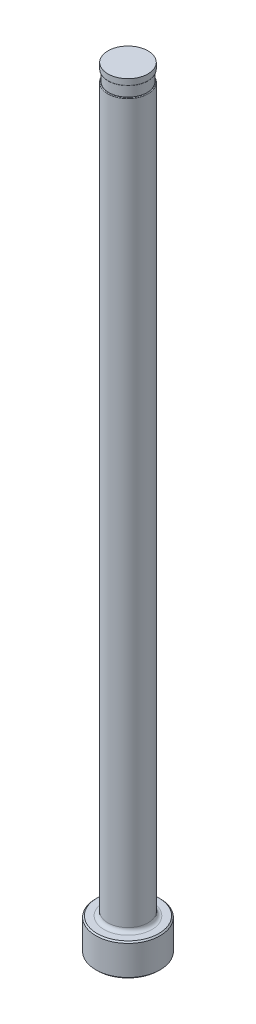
ISO-10303-21;
HEADER;
FILE_DESCRIPTION(('STEP AP214'),'2;1');
FILE_NAME('part.step','',(''),(''),'','','');
FILE_SCHEMA(('AUTOMOTIVE_DESIGN { 1 0 10303 214 1 1 1 1 }'));
ENDSEC;
DATA;
#1=APPLICATION_CONTEXT('core data for automotive mechanical design processes');
#2=APPLICATION_PROTOCOL_DEFINITION('international standard','automotive_design',2000,#1);
#3=PRODUCT_CONTEXT('',#1,'mechanical');
#4=PRODUCT('Part','Part','',(#3));
#5=PRODUCT_RELATED_PRODUCT_CATEGORY('part','',(#4));
#6=PRODUCT_DEFINITION_FORMATION('','',#4);
#7=PRODUCT_DEFINITION_CONTEXT('part definition',#1,'design');
#8=PRODUCT_DEFINITION('design','',#6,#7);
#9=PRODUCT_DEFINITION_SHAPE('','',#8);
#10=(LENGTH_UNIT() NAMED_UNIT(*) SI_UNIT(.MILLI.,.METRE.));
#11=(NAMED_UNIT(*) PLANE_ANGLE_UNIT() SI_UNIT($,.RADIAN.));
#12=(NAMED_UNIT(*) SI_UNIT($,.STERADIAN.) SOLID_ANGLE_UNIT());
#13=UNCERTAINTY_MEASURE_WITH_UNIT(LENGTH_MEASURE(1.E-05),#10,'distance_accuracy_value','');
#14=(GEOMETRIC_REPRESENTATION_CONTEXT(3) GLOBAL_UNCERTAINTY_ASSIGNED_CONTEXT((#13)) GLOBAL_UNIT_ASSIGNED_CONTEXT((#10,
#11,#12)) REPRESENTATION_CONTEXT('',''));
#15=CARTESIAN_POINT('',(0.,0.,0.));
#16=DIRECTION('',(0.,0.,1.));
#17=DIRECTION('',(1.,0.,0.));
#18=AXIS2_PLACEMENT_3D('',#15,#16,#17);
#19=CARTESIAN_POINT('',(-3.96874999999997,151.13,0.));
#20=DIRECTION('',(0.,1.,0.));
#21=DIRECTION('',(0.,0.,1.));
#22=AXIS2_PLACEMENT_3D('',#19,#20,#21);
#23=PLANE('',#22);
#24=CARTESIAN_POINT('',(0.,151.13,0.));
#25=DIRECTION('',(0.,1.,0.));
#26=DIRECTION('',(0.,0.,1.));
#27=AXIS2_PLACEMENT_3D('',#24,#25,#26);
#28=CIRCLE('',#27,3.82904999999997);
#29=CARTESIAN_POINT('',(0.,151.13,3.82904999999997));
#30=VERTEX_POINT('',#29);
#31=EDGE_CURVE('E11',#30,#30,#28,.F.);
#32=ORIENTED_EDGE('',*,*,#31,.T.);
#33=EDGE_LOOP('',(#32));
#34=FACE_BOUND('',#33,.T.);
#35=CARTESIAN_POINT('',(0.,151.13,0.));
#36=DIRECTION('',(0.,1.,0.));
#37=DIRECTION('',(0.,0.,1.));
#38=AXIS2_PLACEMENT_3D('',#35,#36,#37);
#39=CIRCLE('',#38,3.76554999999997);
#40=CARTESIAN_POINT('',(0.,151.13,3.76554999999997));
#41=VERTEX_POINT('',#40);
#42=EDGE_CURVE('E78',#41,#41,#39,.T.);
#43=ORIENTED_EDGE('',*,*,#42,.T.);
#44=EDGE_LOOP('',(#43));
#45=FACE_BOUND('',#44,.T.);
#46=ADVANCED_FACE('F36',(#34,#45),#23,.F.);
#47=CARTESIAN_POINT('',(0.,259.958771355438,0.));
#48=DIRECTION('',(0.,1.,0.));
#49=DIRECTION('',(0.,0.,1.));
#50=AXIS2_PLACEMENT_3D('',#47,#48,#49);
#51=CYLINDRICAL_SURFACE('',#50,3.96874999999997);
#52=DIRECTION('',(0.,1.,0.));
#53=VECTOR('',#52,1.);
#54=CARTESIAN_POINT('',(-3.76554999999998,259.958771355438,-1.25363860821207));
#55=LINE('',#54,#53);
#56=CARTESIAN_POINT('',(-3.76554999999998,148.971,-1.25363860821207));
#57=VERTEX_POINT('',#56);
#58=CARTESIAN_POINT('',(-3.76554999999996,86.614,-1.25363860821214));
#59=VERTEX_POINT('',#58);
#60=EDGE_CURVE('E73',#57,#59,#55,.F.);
#61=ORIENTED_EDGE('',*,*,#60,.F.);
#62=CARTESIAN_POINT('',(0.,148.971,0.));
#63=DIRECTION('',(0.,-1.,0.));
#64=DIRECTION('',(0.,0.,-1.));
#65=AXIS2_PLACEMENT_3D('',#62,#63,#64);
#66=CIRCLE('',#65,3.96874999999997);
#67=CARTESIAN_POINT('',(-3.76554999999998,148.971,1.25363860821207));
#68=VERTEX_POINT('',#67);
#69=EDGE_CURVE('E51',#57,#68,#66,.T.);
#70=ORIENTED_EDGE('',*,*,#69,.T.);
#71=DIRECTION('',(0.,1.,0.));
#72=VECTOR('',#71,1.);
#73=CARTESIAN_POINT('',(-3.76554999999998,259.958771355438,1.25363860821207));
#74=LINE('',#73,#72);
#75=CARTESIAN_POINT('',(-3.76554999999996,86.614,1.25363860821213));
#76=VERTEX_POINT('',#75);
#77=EDGE_CURVE('E84',#76,#68,#74,.T.);
#78=ORIENTED_EDGE('',*,*,#77,.F.);
#79=CARTESIAN_POINT('',(-3.76554999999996,86.614,-1.25363860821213));
#80=CARTESIAN_POINT('',(-3.76554761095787,86.5842664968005,-1.25363893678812));
#81=CARTESIAN_POINT('',(-3.76596820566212,86.5545487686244,-1.25238314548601));
#82=CARTESIAN_POINT('',(-3.76762981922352,86.4953538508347,-1.24737825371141));
#83=CARTESIAN_POINT('',(-3.76887065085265,86.4658766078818,-1.24362972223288));
#84=CARTESIAN_POINT('',(-3.77377172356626,86.3783445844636,-1.22871446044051));
#85=CARTESIAN_POINT('',(-3.7786109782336,86.3209361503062,-1.21387766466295));
#86=CARTESIAN_POINT('',(-3.79089599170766,86.2097164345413,-1.17494432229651));
#87=CARTESIAN_POINT('',(-3.79834108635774,86.1559042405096,-1.15085013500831));
#88=CARTESIAN_POINT('',(-3.81503450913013,86.0532087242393,-1.09423745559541));
#89=CARTESIAN_POINT('',(-3.82428345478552,86.0043270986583,-1.06171607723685));
#90=CARTESIAN_POINT('',(-3.84371902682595,85.912215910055,-0.989050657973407));
#91=CARTESIAN_POINT('',(-3.85391232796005,85.8690327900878,-0.94884982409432));
#92=CARTESIAN_POINT('',(-3.87421414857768,85.789439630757,-0.862218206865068));
#93=CARTESIAN_POINT('',(-3.88432263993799,85.7530317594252,-0.815785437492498));
#94=CARTESIAN_POINT('',(-3.90447970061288,85.6843203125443,-0.713424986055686));
#95=CARTESIAN_POINT('',(-3.91443636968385,85.6527071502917,-0.657016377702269));
#96=CARTESIAN_POINT('',(-3.93230837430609,85.5981594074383,-0.539855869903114));
#97=CARTESIAN_POINT('',(-3.94022284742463,85.5752284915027,-0.479102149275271));
#98=CARTESIAN_POINT('',(-3.95405226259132,85.5360681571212,-0.348163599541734));
#99=CARTESIAN_POINT('',(-3.95966879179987,85.520798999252,-0.277659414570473));
#100=CARTESIAN_POINT('',(-3.96709876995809,85.5007501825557,-0.134969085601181));
#101=CARTESIAN_POINT('',(-3.96891039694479,85.4959755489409,-0.0627821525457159));
#102=CARTESIAN_POINT('',(-3.96855474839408,85.4969169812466,0.0868803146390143));
#103=CARTESIAN_POINT('',(-3.96608295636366,85.5034359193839,0.16435170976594));
#104=CARTESIAN_POINT('',(-3.95680487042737,85.5286115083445,0.317057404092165));
#105=CARTESIAN_POINT('',(-3.94999780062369,85.5472703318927,0.392291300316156));
#106=CARTESIAN_POINT('',(-3.93277618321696,85.5968426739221,0.538182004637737));
#107=CARTESIAN_POINT('',(-3.92236273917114,85.6277524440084,0.608840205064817));
#108=CARTESIAN_POINT('',(-3.8991687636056,85.7017930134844,0.743029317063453));
#109=CARTESIAN_POINT('',(-3.88638957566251,85.7449168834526,0.806564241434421));
#110=CARTESIAN_POINT('',(-3.86127801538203,85.838843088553,0.919000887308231));
#111=CARTESIAN_POINT('',(-3.84899411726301,85.8887331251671,0.968673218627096));
#112=CARTESIAN_POINT('',(-3.82552074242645,85.9973276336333,1.05758636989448));
#113=CARTESIAN_POINT('',(-3.81433058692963,86.0560265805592,1.09683368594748));
#114=CARTESIAN_POINT('',(-3.79578266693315,86.1733369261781,1.15929047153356));
#115=CARTESIAN_POINT('',(-3.78813455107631,86.2312068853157,1.18381204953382));
#116=CARTESIAN_POINT('',(-3.77592606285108,86.350640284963,1.2221998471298));
#117=CARTESIAN_POINT('',(-3.77135975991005,86.4121963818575,1.23608653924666));
#118=CARTESIAN_POINT('',(-3.76759831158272,86.4976117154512,1.24747178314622));
#119=CARTESIAN_POINT('',(-3.76683119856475,86.520841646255,1.24978469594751));
#120=CARTESIAN_POINT('',(-3.76580747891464,86.5673769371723,1.25286606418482));
#121=CARTESIAN_POINT('',(-3.76555004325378,86.5906821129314,1.25363702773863));
#122=CARTESIAN_POINT('',(-3.76554999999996,86.614,1.25363860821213));
#123=B_SPLINE_CURVE_WITH_KNOTS('',3,(#79,#80,#81,#82,#83,#84,#85,#86,#87,#88,#89,#90,#91,#92,
#93,#94,#95,#96,#97,#98,#99,#100,#101,#102,#103,#104,#105,#106,#107,#108,#109,#110,#111,#112,
#113,#114,#115,#116,#117,#118,#119,#120,#121,#122),.UNSPECIFIED.,.F.,.F.,(4,2,2,2,2,2,2,2,2,2,2,
2,2,2,2,2,2,2,2,2,2,4),(0.,0.0891400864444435,0.178259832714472,0.355749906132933,
0.533194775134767,0.710700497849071,0.88957367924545,1.06850400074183,1.26397301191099,
1.45952443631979,1.67567306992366,1.89192518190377,2.12418795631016,2.35649231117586,
2.58872564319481,2.82082748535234,3.03401201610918,3.24706339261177,3.43601078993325,
3.62459353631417,3.6946217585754,3.76453598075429),.UNSPECIFIED.);
#124=EDGE_CURVE('E81',#59,#76,#123,.T.);
#125=ORIENTED_EDGE('',*,*,#124,.F.);
#126=EDGE_LOOP('',(#61,#70,#78,#125));
#127=FACE_BOUND('',#126,.T.);
#128=CARTESIAN_POINT('',(0.,7.11200000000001,0.));
#129=DIRECTION('',(0.,1.,0.));
#130=DIRECTION('',(0.,0.,1.));
#131=AXIS2_PLACEMENT_3D('',#128,#129,#130);
#132=CIRCLE('',#131,3.96874999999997);
#133=CARTESIAN_POINT('',(0.,7.11200000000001,3.96874999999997));
#134=VERTEX_POINT('',#133);
#135=EDGE_CURVE('E116',#134,#134,#132,.T.);
#136=ORIENTED_EDGE('',*,*,#135,.T.);
#137=EDGE_LOOP('',(#136));
#138=FACE_BOUND('',#137,.T.);
#139=ADVANCED_FACE('F82',(#127,#138),#51,.T.);
#140=CARTESIAN_POINT('',(0.,0.,0.));
#141=DIRECTION('',(0.,-1.,0.));
#142=DIRECTION('',(0.,0.,-1.));
#143=AXIS2_PLACEMENT_3D('',#140,#141,#142);
#144=PLANE('',#143);
#145=CARTESIAN_POINT('',(0.,0.,0.));
#146=DIRECTION('',(0.,-1.,0.));
#147=DIRECTION('',(0.,0.,-1.));
#148=AXIS2_PLACEMENT_3D('',#145,#146,#147);
#149=CIRCLE('',#148,6.09599999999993);
#150=CARTESIAN_POINT('',(0.,0.,-6.09599999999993));
#151=VERTEX_POINT('',#150);
#152=EDGE_CURVE('E113',#151,#151,#149,.T.);
#153=ORIENTED_EDGE('',*,*,#152,.T.);
#154=EDGE_LOOP('',(#153));
#155=FACE_BOUND('',#154,.T.);
#156=ADVANCED_FACE('F192',(#155),#144,.T.);
#157=CARTESIAN_POINT('',(0.,259.958771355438,0.));
#158=DIRECTION('',(0.,1.,0.));
#159=DIRECTION('',(0.,0.,1.));
#160=AXIS2_PLACEMENT_3D('',#157,#158,#159);
#161=CYLINDRICAL_SURFACE('',#160,6.34999999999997);
#162=CARTESIAN_POINT('',(0.,6.09599999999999,0.));
#163=DIRECTION('',(0.,1.,0.));
#164=DIRECTION('',(0.,0.,1.));
#165=AXIS2_PLACEMENT_3D('',#162,#163,#164);
#166=CIRCLE('',#165,6.34999999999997);
#167=CARTESIAN_POINT('',(0.,6.09599999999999,6.34999999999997));
#168=VERTEX_POINT('',#167);
#169=EDGE_CURVE('E110',#168,#168,#166,.F.);
#170=ORIENTED_EDGE('',*,*,#169,.T.);
#171=EDGE_LOOP('',(#170));
#172=FACE_BOUND('',#171,.T.);
#173=CARTESIAN_POINT('',(0.,0.254000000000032,0.));
#174=DIRECTION('',(0.,-1.,0.));
#175=DIRECTION('',(0.,0.,-1.));
#176=AXIS2_PLACEMENT_3D('',#173,#174,#175);
#177=CIRCLE('',#176,6.34999999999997);
#178=CARTESIAN_POINT('',(0.,0.254000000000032,-6.34999999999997));
#179=VERTEX_POINT('',#178);
#180=EDGE_CURVE('E107',#179,#179,#177,.F.);
#181=ORIENTED_EDGE('',*,*,#180,.T.);
#182=EDGE_LOOP('',(#181));
#183=FACE_BOUND('',#182,.T.);
#184=ADVANCED_FACE('F195',(#172,#183),#161,.T.);
#185=CARTESIAN_POINT('',(-6.34999999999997,6.35,0.));
#186=DIRECTION('',(0.,1.,0.));
#187=DIRECTION('',(0.,0.,1.));
#188=AXIS2_PLACEMENT_3D('',#185,#186,#187);
#189=PLANE('',#188);
#190=CARTESIAN_POINT('',(0.,6.35,0.));
#191=DIRECTION('',(0.,1.,0.));
#192=DIRECTION('',(0.,0.,1.));
#193=AXIS2_PLACEMENT_3D('',#190,#191,#192);
#194=CIRCLE('',#193,4.73074999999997);
#195=CARTESIAN_POINT('',(0.,6.35,4.73074999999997));
#196=VERTEX_POINT('',#195);
#197=EDGE_CURVE('E87',#196,#196,#194,.F.);
#198=ORIENTED_EDGE('',*,*,#197,.T.);
#199=EDGE_LOOP('',(#198));
#200=FACE_BOUND('',#199,.T.);
#201=CARTESIAN_POINT('',(0.,6.35,0.));
#202=DIRECTION('',(0.,1.,0.));
#203=DIRECTION('',(0.,0.,1.));
#204=AXIS2_PLACEMENT_3D('',#201,#202,#203);
#205=CIRCLE('',#204,6.096);
#206=CARTESIAN_POINT('',(0.,6.35,6.096));
#207=VERTEX_POINT('',#206);
#208=EDGE_CURVE('E104',#207,#207,#205,.T.);
#209=ORIENTED_EDGE('',*,*,#208,.T.);
#210=EDGE_LOOP('',(#209));
#211=FACE_BOUND('',#210,.T.);
#212=ADVANCED_FACE('F190',(#200,#211),#189,.T.);
#213=CARTESIAN_POINT('',(0.,6.35000000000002,0.));
#214=DIRECTION('',(0.,-1.,0.));
#215=DIRECTION('',(0.,0.,-1.));
#216=AXIS2_PLACEMENT_3D('',#213,#214,#215);
#217=CONICAL_SURFACE('',#216,6.09599999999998,0.78539816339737);
#218=ORIENTED_EDGE('',*,*,#169,.F.);
#219=EDGE_LOOP('',(#218));
#220=FACE_BOUND('',#219,.T.);
#221=ORIENTED_EDGE('',*,*,#208,.F.);
#222=EDGE_LOOP('',(#221));
#223=FACE_BOUND('',#222,.T.);
#224=ADVANCED_FACE('F186',(#220,#223),#217,.T.);
#225=CARTESIAN_POINT('',(0.,0.254000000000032,0.));
#226=DIRECTION('',(0.,1.,0.));
#227=DIRECTION('',(0.,0.,1.));
#228=AXIS2_PLACEMENT_3D('',#225,#226,#227);
#229=CONICAL_SURFACE('',#228,6.34999999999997,0.785398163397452);
#230=ORIENTED_EDGE('',*,*,#152,.F.);
#231=EDGE_LOOP('',(#230));
#232=FACE_BOUND('',#231,.T.);
#233=ORIENTED_EDGE('',*,*,#180,.F.);
#234=EDGE_LOOP('',(#233));
#235=FACE_BOUND('',#234,.T.);
#236=ADVANCED_FACE('F182',(#232,#235),#229,.T.);
#237=CARTESIAN_POINT('',(0.,7.11200000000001,0.));
#238=DIRECTION('',(0.,1.,0.));
#239=DIRECTION('',(0.,0.,1.));
#240=AXIS2_PLACEMENT_3D('',#237,#238,#239);
#241=TOROIDAL_SURFACE('',#240,4.73074999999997,0.762);
#242=ORIENTED_EDGE('',*,*,#197,.F.);
#243=EDGE_LOOP('',(#242));
#244=FACE_BOUND('',#243,.T.);
#245=ORIENTED_EDGE('',*,*,#135,.F.);
#246=EDGE_LOOP('',(#245));
#247=FACE_BOUND('',#246,.T.);
#248=ADVANCED_FACE('F147',(#244,#247),#241,.F.);
#249=CARTESIAN_POINT('',(-3.96874999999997,149.098,0.));
#250=DIRECTION('',(0.,-1.,0.));
#251=DIRECTION('',(0.,0.,-1.));
#252=AXIS2_PLACEMENT_3D('',#249,#250,#251);
#253=PLANE('',#252);
#254=DIRECTION('',(0.,0.,1.));
#255=VECTOR('',#254,1.);
#256=CARTESIAN_POINT('',(-3.76554999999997,149.098,0.));
#257=LINE('',#256,#255);
#258=CARTESIAN_POINT('',(-3.76554999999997,149.098,0.));
#259=VERTEX_POINT('',#258);
#260=CARTESIAN_POINT('',(-3.76554999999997,149.098,0.761364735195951));
#261=VERTEX_POINT('',#260);
#262=EDGE_CURVE('E90',#259,#261,#257,.T.);
#263=ORIENTED_EDGE('',*,*,#262,.T.);
#264=CARTESIAN_POINT('',(0.,149.098,0.));
#265=DIRECTION('',(0.,-1.,0.));
#266=DIRECTION('',(0.,0.,-1.));
#267=AXIS2_PLACEMENT_3D('',#264,#265,#266);
#268=CIRCLE('',#267,3.84174999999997);
#269=CARTESIAN_POINT('',(-3.76554999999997,149.098,-0.761364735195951));
#270=VERTEX_POINT('',#269);
#271=EDGE_CURVE('E86',#261,#270,#268,.F.);
#272=ORIENTED_EDGE('',*,*,#271,.T.);
#273=EDGE_CURVE('E79',#270,#259,#257,.T.);
#274=ORIENTED_EDGE('',*,*,#273,.T.);
#275=CARTESIAN_POINT('',(0.,149.098,0.));
#276=DIRECTION('',(0.,1.,0.));
#277=DIRECTION('',(0.,0.,1.));
#278=AXIS2_PLACEMENT_3D('',#275,#276,#277);
#279=CIRCLE('',#278,3.76554999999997);
#280=EDGE_CURVE('E101',#259,#259,#279,.T.);
#281=ORIENTED_EDGE('',*,*,#280,.F.);
#282=EDGE_LOOP('',(#263,#272,#274,#281));
#283=FACE_BOUND('',#282,.T.);
#284=ADVANCED_FACE('F144',(#283),#253,.F.);
#285=CARTESIAN_POINT('',(0.,153.448281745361,0.));
#286=DIRECTION('',(0.,1.,0.));
#287=DIRECTION('',(0.,0.,1.));
#288=AXIS2_PLACEMENT_3D('',#285,#286,#287);
#289=CYLINDRICAL_SURFACE('',#288,3.76554999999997);
#290=ORIENTED_EDGE('',*,*,#42,.F.);
#291=EDGE_LOOP('',(#290));
#292=FACE_BOUND('',#291,.T.);
#293=ORIENTED_EDGE('',*,*,#280,.T.);
#294=EDGE_LOOP('',(#293));
#295=FACE_BOUND('',#294,.T.);
#296=ADVANCED_FACE('F141',(#292,#295),#289,.T.);
#297=CARTESIAN_POINT('',(-3.76554999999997,150.114,-6.34999999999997));
#298=DIRECTION('',(1.,0.,0.));
#299=DIRECTION('',(0.,1.,0.));
#300=AXIS2_PLACEMENT_3D('',#297,#298,#299);
#301=PLANE('',#300);
#302=ORIENTED_EDGE('',*,*,#273,.F.);
#303=CARTESIAN_POINT('',(-3.76554999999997,149.098,-0.761364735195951));
#304=CARTESIAN_POINT('',(-3.76554999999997,149.097994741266,-0.782493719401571));
#305=CARTESIAN_POINT('',(-3.76554999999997,149.097792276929,-0.803626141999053));
#306=CARTESIAN_POINT('',(-3.76554999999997,149.096859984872,-0.845902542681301));
#307=CARTESIAN_POINT('',(-3.76554999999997,149.096129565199,-0.867046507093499));
#308=CARTESIAN_POINT('',(-3.76554999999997,149.094000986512,-0.909439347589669));
#309=CARTESIAN_POINT('',(-3.76554999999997,149.092598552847,-0.930688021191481));
#310=CARTESIAN_POINT('',(-3.76554999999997,149.088932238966,-0.97310444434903));
#311=CARTESIAN_POINT('',(-3.76554999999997,149.086668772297,-0.994272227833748));
#312=CARTESIAN_POINT('',(-3.76554999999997,149.081963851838,-1.02925031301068));
#313=CARTESIAN_POINT('',(-3.76554999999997,149.079847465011,-1.04310326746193));
#314=CARTESIAN_POINT('',(-3.76554999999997,149.074992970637,-1.07067599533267));
#315=CARTESIAN_POINT('',(-3.76554999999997,149.072255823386,-1.08439594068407));
#316=CARTESIAN_POINT('',(-3.76554999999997,149.064714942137,-1.117227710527));
#317=CARTESIAN_POINT('',(-3.76554999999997,149.059523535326,-1.13626053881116));
#318=CARTESIAN_POINT('',(-3.76554999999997,149.049554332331,-1.1650285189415));
#319=CARTESIAN_POINT('',(-3.76554999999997,149.045656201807,-1.17506664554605));
#320=CARTESIAN_POINT('',(-3.76554999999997,149.036804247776,-1.19465815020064));
#321=CARTESIAN_POINT('',(-3.76554999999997,149.031854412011,-1.2042131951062));
#322=CARTESIAN_POINT('',(-3.76554999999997,149.023843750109,-1.21677899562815));
#323=CARTESIAN_POINT('',(-3.76554999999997,149.021472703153,-1.22022603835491));
#324=CARTESIAN_POINT('',(-3.76554999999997,149.016417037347,-1.22689753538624));
#325=CARTESIAN_POINT('',(-3.76554999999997,149.013731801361,-1.23012153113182));
#326=CARTESIAN_POINT('',(-3.76554999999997,149.007951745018,-1.23626135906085));
#327=CARTESIAN_POINT('',(-3.76554999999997,149.004852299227,-1.23917292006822));
#328=CARTESIAN_POINT('',(-3.76554999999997,148.998201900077,-1.24442799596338));
#329=CARTESIAN_POINT('',(-3.76554999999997,148.994652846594,-1.24677378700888));
#330=CARTESIAN_POINT('',(-3.76554999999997,148.988648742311,-1.2497967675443));
#331=CARTESIAN_POINT('',(-3.76554999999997,148.986340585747,-1.25076391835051));
#332=CARTESIAN_POINT('',(-3.76554999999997,148.981598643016,-1.25230606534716));
#333=CARTESIAN_POINT('',(-3.76554999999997,148.979165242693,-1.2528821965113));
#334=CARTESIAN_POINT('',(-3.76554999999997,148.975758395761,-1.25336754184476));
#335=CARTESIAN_POINT('',(-3.76554999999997,148.974810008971,-1.2534689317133));
#336=CARTESIAN_POINT('',(-3.76554999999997,148.972907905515,-1.25360450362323));
#337=CARTESIAN_POINT('',(-3.76554999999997,148.971954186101,-1.25363864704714));
#338=CARTESIAN_POINT('',(-3.76554999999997,148.971,-1.25363860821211));
#339=B_SPLINE_CURVE_WITH_KNOTS('',3,(#303,#304,#305,#306,#307,#308,#309,#310,#311,#312,#313,
#314,#315,#316,#317,#318,#319,#320,#321,#322,#323,#324,#325,#326,#327,#328,#329,#330,#331,#332,
#333,#334,#335,#336,#337,#338),.UNSPECIFIED.,.F.,.F.,(4,2,2,2,2,2,2,2,2,2,2,2,2,2,2,2,2,4),(0.,
0.0633913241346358,0.126853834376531,0.19072549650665,0.254566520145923,0.29659421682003,
0.338557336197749,0.397605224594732,0.429880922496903,0.462036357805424,0.474575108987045,
0.487138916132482,0.499857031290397,0.512523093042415,0.520004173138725,0.527463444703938,
0.530322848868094,0.533183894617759),.UNSPECIFIED.);
#340=EDGE_CURVE('E59',#270,#57,#339,.T.);
#341=ORIENTED_EDGE('',*,*,#340,.T.);
#342=ORIENTED_EDGE('',*,*,#60,.T.);
#343=DIRECTION('',(0.,0.,1.));
#344=VECTOR('',#343,1.);
#345=CARTESIAN_POINT('',(-3.76554999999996,86.614,-6.34999999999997));
#346=LINE('',#345,#344);
#347=EDGE_CURVE('E77',#59,#76,#346,.T.);
#348=ORIENTED_EDGE('',*,*,#347,.T.);
#349=ORIENTED_EDGE('',*,*,#77,.T.);
#350=CARTESIAN_POINT('',(-3.76554999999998,148.971,1.25363860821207));
#351=CARTESIAN_POINT('',(-3.76554999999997,148.973613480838,1.25364684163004));
#352=CARTESIAN_POINT('',(-3.76554999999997,148.976215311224,1.25338363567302));
#353=CARTESIAN_POINT('',(-3.76554999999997,148.981293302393,1.25239294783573));
#354=CARTESIAN_POINT('',(-3.76554999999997,148.983770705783,1.25167195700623));
#355=CARTESIAN_POINT('',(-3.76554999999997,148.989154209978,1.24961912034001));
#356=CARTESIAN_POINT('',(-3.76554999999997,148.992019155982,1.24818173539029));
#357=CARTESIAN_POINT('',(-3.76554999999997,148.997493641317,1.24486563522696));
#358=CARTESIAN_POINT('',(-3.76554999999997,149.00010160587,1.24298441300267));
#359=CARTESIAN_POINT('',(-3.76554999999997,149.006800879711,1.23749178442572));
#360=CARTESIAN_POINT('',(-3.76554999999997,149.010652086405,1.23359127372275));
#361=CARTESIAN_POINT('',(-3.76554999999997,149.017763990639,1.22529610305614));
#362=CARTESIAN_POINT('',(-3.76554999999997,149.021023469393,1.22090045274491));
#363=CARTESIAN_POINT('',(-3.76554999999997,149.032610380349,1.203601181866));
#364=CARTESIAN_POINT('',(-3.76554999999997,149.039424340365,1.18970762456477));
#365=CARTESIAN_POINT('',(-3.76554999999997,149.051184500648,1.16115732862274));
#366=CARTESIAN_POINT('',(-3.76554999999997,149.056117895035,1.1464961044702));
#367=CARTESIAN_POINT('',(-3.76554999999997,149.067974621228,1.10570448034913));
#368=CARTESIAN_POINT('',(-3.76554999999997,149.073623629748,1.07920308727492));
#369=CARTESIAN_POINT('',(-3.76554999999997,149.08273714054,1.02581528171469));
#370=CARTESIAN_POINT('',(-3.76554999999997,149.086195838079,0.998928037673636));
#371=CARTESIAN_POINT('',(-3.76554999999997,149.091595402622,0.944998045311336));
#372=CARTESIAN_POINT('',(-3.76554999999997,149.093536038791,0.9179552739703));
#373=CARTESIAN_POINT('',(-3.76554999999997,149.096323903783,0.863847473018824));
#374=CARTESIAN_POINT('',(-3.76554999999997,149.097172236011,0.836782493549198));
#375=CARTESIAN_POINT('',(-3.76554999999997,149.097747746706,0.801647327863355));
#376=CARTESIAN_POINT('',(-3.76554999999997,149.09784390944,0.793581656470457));
#377=CARTESIAN_POINT('',(-3.76554999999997,149.097969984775,0.777465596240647));
#378=CARTESIAN_POINT('',(-3.76554999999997,149.098000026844,0.769415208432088));
#379=CARTESIAN_POINT('',(-3.76554999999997,149.098,0.761364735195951));
#380=B_SPLINE_CURVE_WITH_KNOTS('',3,(#350,#351,#352,#353,#354,#355,#356,#357,#358,#359,#360,
#361,#362,#363,#364,#365,#366,#367,#368,#369,#370,#371,#372,#373,#374,#375,#376,#377,#378,#379),
.UNSPECIFIED.,.F.,.F.,(4,2,2,2,2,2,2,2,2,2,2,2,2,2,4),(0.,0.00780850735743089,0.01550869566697,
0.0250704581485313,0.0346875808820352,0.0510390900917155,0.0674239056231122,0.113484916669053,
0.159854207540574,0.240929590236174,0.322218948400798,0.403520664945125,0.484740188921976,
0.508938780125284,0.533089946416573),.UNSPECIFIED.);
#381=EDGE_CURVE('E172',#68,#261,#380,.T.);
#382=ORIENTED_EDGE('',*,*,#381,.T.);
#383=ORIENTED_EDGE('',*,*,#262,.F.);
#384=EDGE_LOOP('',(#302,#341,#342,#348,#349,#382,#383));
#385=FACE_BOUND('',#384,.T.);
#386=ADVANCED_FACE('F75',(#385),#301,.F.);
#387=CARTESIAN_POINT('',(-6.94054999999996,86.614,-6.34999999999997));
#388=DIRECTION('',(0.,0.,1.));
#389=DIRECTION('',(1.,0.,0.));
#390=AXIS2_PLACEMENT_3D('',#387,#388,#389);
#391=CYLINDRICAL_SURFACE('',#390,3.175);
#392=ORIENTED_EDGE('',*,*,#347,.F.);
#393=ORIENTED_EDGE('',*,*,#124,.T.);
#394=EDGE_LOOP('',(#392,#393));
#395=FACE_BOUND('',#394,.T.);
#396=ADVANCED_FACE('F89',(#395),#391,.F.);
#397=CARTESIAN_POINT('',(0.,152.687735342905,0.));
#398=DIRECTION('',(0.,1.,0.));
#399=DIRECTION('',(0.,0.,1.));
#400=AXIS2_PLACEMENT_3D('',#397,#398,#399);
#401=CYLINDRICAL_SURFACE('',#400,3.95604999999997);
#402=CARTESIAN_POINT('',(0.,151.257,0.));
#403=DIRECTION('',(0.,1.,0.));
#404=DIRECTION('',(0.,0.,1.));
#405=AXIS2_PLACEMENT_3D('',#402,#403,#404);
#406=CIRCLE('',#405,3.95604999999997);
#407=CARTESIAN_POINT('',(0.,151.257,3.95604999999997));
#408=VERTEX_POINT('',#407);
#409=EDGE_CURVE('E44',#408,#408,#406,.T.);
#410=ORIENTED_EDGE('',*,*,#409,.T.);
#411=EDGE_LOOP('',(#410));
#412=FACE_BOUND('',#411,.T.);
#413=CARTESIAN_POINT('',(0.,152.4,0.));
#414=DIRECTION('',(0.,1.,0.));
#415=DIRECTION('',(0.,0.,1.));
#416=AXIS2_PLACEMENT_3D('',#413,#414,#415);
#417=CIRCLE('',#416,3.95604999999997);
#418=CARTESIAN_POINT('',(0.,152.4,3.95604999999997));
#419=VERTEX_POINT('',#418);
#420=EDGE_CURVE('E91',#419,#419,#417,.T.);
#421=ORIENTED_EDGE('',*,*,#420,.F.);
#422=EDGE_LOOP('',(#421));
#423=FACE_BOUND('',#422,.T.);
#424=ADVANCED_FACE('F135',(#412,#423),#401,.T.);
#425=CARTESIAN_POINT('',(-3.96874999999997,152.4,0.));
#426=DIRECTION('',(0.,1.,0.));
#427=DIRECTION('',(0.,0.,1.));
#428=AXIS2_PLACEMENT_3D('',#425,#426,#427);
#429=PLANE('',#428);
#430=ORIENTED_EDGE('',*,*,#420,.T.);
#431=EDGE_LOOP('',(#430));
#432=FACE_BOUND('',#431,.T.);
#433=ADVANCED_FACE('F149',(#432),#429,.T.);
#434=CARTESIAN_POINT('',(0.,148.971,0.));
#435=DIRECTION('',(0.,-1.,0.));
#436=DIRECTION('',(0.,0.,-1.));
#437=AXIS2_PLACEMENT_3D('',#434,#435,#436);
#438=TOROIDAL_SURFACE('',#437,3.84174999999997,0.127);
#439=ORIENTED_EDGE('',*,*,#381,.F.);
#440=ORIENTED_EDGE('',*,*,#69,.F.);
#441=ORIENTED_EDGE('',*,*,#340,.F.);
#442=ORIENTED_EDGE('',*,*,#271,.F.);
#443=EDGE_LOOP('',(#439,#440,#441,#442));
#444=FACE_BOUND('',#443,.T.);
#445=ADVANCED_FACE('F151',(#444),#438,.T.);
#446=CARTESIAN_POINT('',(0.,151.257,0.));
#447=DIRECTION('',(0.,1.,0.));
#448=DIRECTION('',(0.,0.,1.));
#449=AXIS2_PLACEMENT_3D('',#446,#447,#448);
#450=TOROIDAL_SURFACE('',#449,3.82904999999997,0.127);
#451=ORIENTED_EDGE('',*,*,#31,.F.);
#452=EDGE_LOOP('',(#451));
#453=FACE_BOUND('',#452,.T.);
#454=ORIENTED_EDGE('',*,*,#409,.F.);
#455=EDGE_LOOP('',(#454));
#456=FACE_BOUND('',#455,.T.);
#457=ADVANCED_FACE('F38',(#453,#456),#450,.T.);
#458=CLOSED_SHELL('',(#46,#139,#156,#184,#212,#224,#236,#248,#284,#296,#386,#396,#424,#433,#445,#457));
#459=MANIFOLD_SOLID_BREP('B2',#458);
#460=ADVANCED_BREP_SHAPE_REPRESENTATION('',(#18,#459),#14);
#461=SHAPE_DEFINITION_REPRESENTATION(#9,#460);
ENDSEC;
END-ISO-10303-21;
